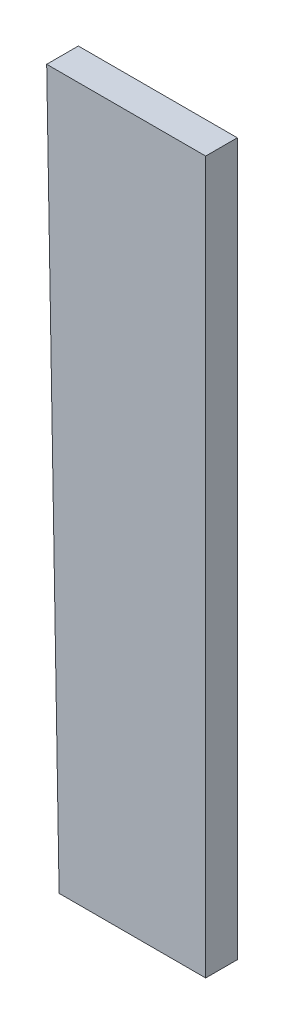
ISO-10303-21;
HEADER;
FILE_DESCRIPTION(('STEP AP214'),'2;1');
FILE_NAME('part.step','',(''),(''),'','','');
FILE_SCHEMA(('AUTOMOTIVE_DESIGN { 1 0 10303 214 1 1 1 1 }'));
ENDSEC;
DATA;
#1=APPLICATION_CONTEXT('core data for automotive mechanical design processes');
#2=APPLICATION_PROTOCOL_DEFINITION('international standard','automotive_design',2000,#1);
#3=PRODUCT_CONTEXT('',#1,'mechanical');
#4=PRODUCT('Part','Part','',(#3));
#5=PRODUCT_RELATED_PRODUCT_CATEGORY('part','',(#4));
#6=PRODUCT_DEFINITION_FORMATION('','',#4);
#7=PRODUCT_DEFINITION_CONTEXT('part definition',#1,'design');
#8=PRODUCT_DEFINITION('design','',#6,#7);
#9=PRODUCT_DEFINITION_SHAPE('','',#8);
#10=(LENGTH_UNIT() NAMED_UNIT(*) SI_UNIT(.MILLI.,.METRE.));
#11=(NAMED_UNIT(*) PLANE_ANGLE_UNIT() SI_UNIT($,.RADIAN.));
#12=(NAMED_UNIT(*) SI_UNIT($,.STERADIAN.) SOLID_ANGLE_UNIT());
#13=UNCERTAINTY_MEASURE_WITH_UNIT(LENGTH_MEASURE(1.E-05),#10,'distance_accuracy_value','');
#14=(GEOMETRIC_REPRESENTATION_CONTEXT(3) GLOBAL_UNCERTAINTY_ASSIGNED_CONTEXT((#13)) GLOBAL_UNIT_ASSIGNED_CONTEXT((#10,
#11,#12)) REPRESENTATION_CONTEXT('',''));
#15=CARTESIAN_POINT('',(0.,0.,0.));
#16=DIRECTION('',(0.,0.,1.));
#17=DIRECTION('',(1.,0.,0.));
#18=AXIS2_PLACEMENT_3D('',#15,#16,#17);
#19=CARTESIAN_POINT('',(44.566480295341,39.693317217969,42.928106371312));
#20=DIRECTION('',(-0.999847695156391,-0.0174524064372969,0.));
#21=DIRECTION('',(-0.0174524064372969,0.999847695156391,0.));
#22=AXIS2_PLACEMENT_3D('',#19,#20,#21);
#23=PLANE('',#22);
#24=DIRECTION('',(0.0174524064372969,-0.999847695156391,0.));
#25=VECTOR('',#24,1.);
#26=CARTESIAN_POINT('',(44.566480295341,39.693317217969,35.928106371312));
#27=LINE('',#26,#25);
#28=CARTESIAN_POINT('',(45.014958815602,14.,35.928106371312));
#29=VERTEX_POINT('',#28);
#30=CARTESIAN_POINT('',(45.172054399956,5.,35.928106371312));
#31=VERTEX_POINT('',#30);
#32=EDGE_CURVE('E9',#29,#31,#27,.T.);
#33=ORIENTED_EDGE('',*,*,#32,.T.);
#34=DIRECTION('',(0.,0.,1.));
#35=VECTOR('',#34,1.);
#36=CARTESIAN_POINT('',(45.172054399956,5.,24.964053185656));
#37=LINE('',#36,#35);
#38=CARTESIAN_POINT('',(45.172054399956,5.,36.328106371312));
#39=VERTEX_POINT('',#38);
#40=EDGE_CURVE('E69',#31,#39,#37,.T.);
#41=ORIENTED_EDGE('',*,*,#40,.T.);
#42=DIRECTION('',(0.0174524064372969,-0.999847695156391,0.));
#43=VECTOR('',#42,1.);
#44=CARTESIAN_POINT('',(44.391908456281,49.694531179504,36.328106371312));
#45=LINE('',#44,#43);
#46=CARTESIAN_POINT('',(45.014958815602,14.,36.328106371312));
#47=VERTEX_POINT('',#46);
#48=EDGE_CURVE('E63',#47,#39,#45,.T.);
#49=ORIENTED_EDGE('',*,*,#48,.F.);
#50=DIRECTION('',(0.,0.,1.));
#51=VECTOR('',#50,1.);
#52=CARTESIAN_POINT('',(45.014958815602,14.,24.964053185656));
#53=LINE('',#52,#51);
#54=EDGE_CURVE('E18',#29,#47,#53,.T.);
#55=ORIENTED_EDGE('',*,*,#54,.F.);
#56=EDGE_LOOP('',(#33,#41,#49,#55));
#57=FACE_BOUND('',#56,.T.);
#58=ADVANCED_FACE('F15',(#57),#23,.T.);
#59=CARTESIAN_POINT('',(44.566480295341,39.693317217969,35.928106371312));
#60=DIRECTION('',(0.,0.,-1.));
#61=DIRECTION('',(0.,-1.,0.));
#62=AXIS2_PLACEMENT_3D('',#59,#60,#61);
#63=PLANE('',#62);
#64=ORIENTED_EDGE('',*,*,#32,.F.);
#65=DIRECTION('',(-1.,0.,0.));
#66=VECTOR('',#65,1.);
#67=CARTESIAN_POINT('',(18.28324014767,14.,35.928106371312));
#68=LINE('',#67,#66);
#69=CARTESIAN_POINT('',(47.025,14.,35.928106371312));
#70=VERTEX_POINT('',#69);
#71=EDGE_CURVE('E98',#70,#29,#68,.T.);
#72=ORIENTED_EDGE('',*,*,#71,.F.);
#73=DIRECTION('',(0.,1.,0.));
#74=VECTOR('',#73,1.);
#75=CARTESIAN_POINT('',(47.025,22.346658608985,35.928106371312));
#76=LINE('',#75,#74);
#77=CARTESIAN_POINT('',(47.025,5.,35.928106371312));
#78=VERTEX_POINT('',#77);
#79=EDGE_CURVE('E76',#78,#70,#76,.T.);
#80=ORIENTED_EDGE('',*,*,#79,.F.);
#81=DIRECTION('',(-1.,0.,0.));
#82=VECTOR('',#81,1.);
#83=CARTESIAN_POINT('',(22.28324014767,5.,35.928106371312));
#84=LINE('',#83,#82);
#85=EDGE_CURVE('E73',#78,#31,#84,.T.);
#86=ORIENTED_EDGE('',*,*,#85,.T.);
#87=EDGE_LOOP('',(#64,#72,#80,#86));
#88=FACE_BOUND('',#87,.T.);
#89=ADVANCED_FACE('F74',(#88),#63,.T.);
#90=CARTESIAN_POINT('',(-8.,14.,7.));
#91=DIRECTION('',(0.,1.,0.));
#92=DIRECTION('',(1.,0.,0.));
#93=AXIS2_PLACEMENT_3D('',#90,#91,#92);
#94=PLANE('',#93);
#95=DIRECTION('',(0.,0.,1.));
#96=VECTOR('',#95,1.);
#97=CARTESIAN_POINT('',(47.025,14.,24.5294293));
#98=LINE('',#97,#96);
#99=CARTESIAN_POINT('',(47.025,14.,36.328106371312));
#100=VERTEX_POINT('',#99);
#101=EDGE_CURVE('E112',#70,#100,#98,.T.);
#102=ORIENTED_EDGE('',*,*,#101,.F.);
#103=ORIENTED_EDGE('',*,*,#71,.T.);
#104=ORIENTED_EDGE('',*,*,#54,.T.);
#105=DIRECTION('',(1.,0.,0.));
#106=VECTOR('',#105,1.);
#107=CARTESIAN_POINT('',(21.658127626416,14.,36.328106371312));
#108=LINE('',#107,#106);
#109=EDGE_CURVE('E81',#47,#100,#108,.T.);
#110=ORIENTED_EDGE('',*,*,#109,.T.);
#111=EDGE_LOOP('',(#102,#103,#104,#110));
#112=FACE_BOUND('',#111,.T.);
#113=ADVANCED_FACE('F106',(#112),#94,.T.);
#114=CARTESIAN_POINT('',(51.316255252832,59.819657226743,36.328106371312));
#115=DIRECTION('',(0.,0.,1.));
#116=DIRECTION('',(0.,-1.,0.));
#117=AXIS2_PLACEMENT_3D('',#114,#115,#116);
#118=PLANE('',#117);
#119=ORIENTED_EDGE('',*,*,#109,.F.);
#120=ORIENTED_EDGE('',*,*,#48,.T.);
#121=DIRECTION('',(1.,0.,0.));
#122=VECTOR('',#121,1.);
#123=CARTESIAN_POINT('',(25.658127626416,5.,36.328106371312));
#124=LINE('',#123,#122);
#125=CARTESIAN_POINT('',(47.025,5.,36.328106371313));
#126=VERTEX_POINT('',#125);
#127=EDGE_CURVE('E84',#39,#126,#124,.T.);
#128=ORIENTED_EDGE('',*,*,#127,.T.);
#129=DIRECTION('',(0.,-1.,0.));
#130=VECTOR('',#129,1.);
#131=CARTESIAN_POINT('',(47.025,32.409828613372,36.328106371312));
#132=LINE('',#131,#130);
#133=EDGE_CURVE('E90',#100,#126,#132,.T.);
#134=ORIENTED_EDGE('',*,*,#133,.F.);
#135=EDGE_LOOP('',(#119,#120,#128,#134));
#136=FACE_BOUND('',#135,.T.);
#137=ADVANCED_FACE('F108',(#136),#118,.T.);
#138=CARTESIAN_POINT('',(0.,5.,7.));
#139=DIRECTION('',(0.,1.,0.));
#140=DIRECTION('',(1.,0.,0.));
#141=AXIS2_PLACEMENT_3D('',#138,#139,#140);
#142=PLANE('',#141);
#143=ORIENTED_EDGE('',*,*,#127,.F.);
#144=ORIENTED_EDGE('',*,*,#40,.F.);
#145=ORIENTED_EDGE('',*,*,#85,.F.);
#146=DIRECTION('',(0.,0.,-1.));
#147=VECTOR('',#146,1.);
#148=CARTESIAN_POINT('',(47.025,5.,24.5294293));
#149=LINE('',#148,#147);
#150=EDGE_CURVE('E117',#126,#78,#149,.T.);
#151=ORIENTED_EDGE('',*,*,#150,.F.);
#152=EDGE_LOOP('',(#143,#144,#145,#151));
#153=FACE_BOUND('',#152,.T.);
#154=ADVANCED_FACE('F83',(#153),#142,.F.);
#155=CARTESIAN_POINT('',(47.025,5.,7.));
#156=DIRECTION('',(1.,0.,0.));
#157=DIRECTION('',(0.,0.,1.));
#158=AXIS2_PLACEMENT_3D('',#155,#156,#157);
#159=PLANE('',#158);
#160=ORIENTED_EDGE('',*,*,#150,.T.);
#161=ORIENTED_EDGE('',*,*,#79,.T.);
#162=ORIENTED_EDGE('',*,*,#101,.T.);
#163=ORIENTED_EDGE('',*,*,#133,.T.);
#164=EDGE_LOOP('',(#160,#161,#162,#163));
#165=FACE_BOUND('',#164,.T.);
#166=ADVANCED_FACE('F113',(#165),#159,.T.);
#167=CLOSED_SHELL('',(#58,#89,#113,#137,#154,#166));
#168=MANIFOLD_SOLID_BREP('B1',#167);
#169=ADVANCED_BREP_SHAPE_REPRESENTATION('',(#18,#168),#14);
#170=SHAPE_DEFINITION_REPRESENTATION(#9,#169);
ENDSEC;
END-ISO-10303-21;
